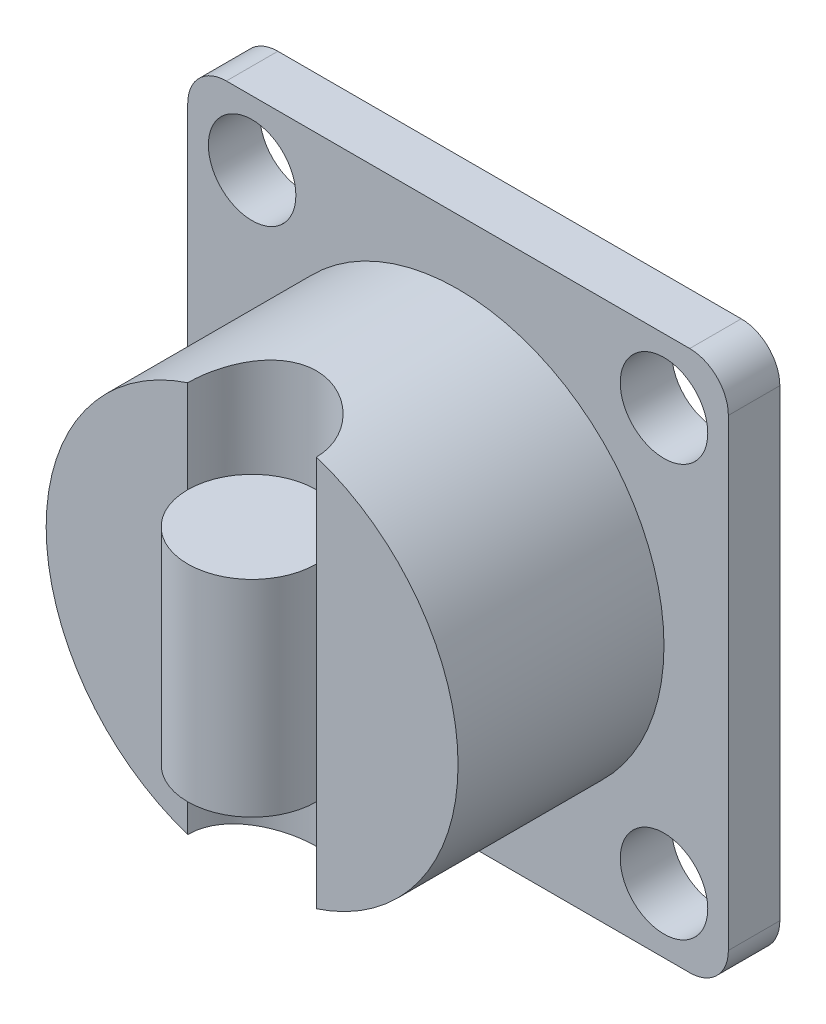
from build123d import *

# Parameters (mm, degrees)
ESQUISSE1_W                     = 21
ESQUISSE1_H                     = 21
EXTRUSION1_DEPTH                = 2
ESQUISSE2_R                     = 8
EXTRUSION2_DEPTH                = 8
ESQUISSE3_R                     = 2.5
ENL_V_MAT_EXTRU_1_DEPTH         = 32.336879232
ESQUISSE4_R                     = 2.5
EXTRUSION3_DEPTH                = 4
D_GAGEMENT_M31_D                = 3.4
R_P_TITION_LIN_AIRE1_COUNT      = 2
R_P_TITION_LIN_AIRE1_PITCH      = 16
R_P_TITION_LIN_AIRE1_COUNT_DIR2 = 2
R_P_TITION_LIN_AIRE1_PITCH_DIR2 = 16
CONG_1_R                        = 1.5


with BuildPart() as part:
    # Esquisse1 → Extrusion1 (new body)
    with BuildSketch(Plane.XY):
        with Locations((-10.5, 10.5)):
            Rectangle(ESQUISSE1_W, ESQUISSE1_H)
    extrude(amount=EXTRUSION1_DEPTH)

    # Esquisse2 → Extrusion2 (add)
    with BuildSketch(Plane.XY.offset(2)):
        with Locations((-10.5, 10.5)):
            Circle(ESQUISSE2_R)
    extrude(amount=EXTRUSION2_DEPTH)

    # Esquisse3 → Enl_v. mat.-Extru.1 (cut, through all)
    with BuildSketch(Plane(origin=(0, 21, 0), x_dir=(-1, 0, 0), z_dir=(0, 1, 0))):
        with Locations((10.5, 10)):
            Circle(ESQUISSE3_R)
    extrude(amount=-ENL_V_MAT_EXTRU_1_DEPTH, mode=Mode.SUBTRACT)

    # Esquisse4 → Extrusion3 (add, symmetric)
    with BuildSketch(Plane(origin=(0, 10.5, 0), x_dir=(-1, 0, 0), z_dir=(0, 1, 0))):
        with Locations((10.5, 10)):
            Circle(ESQUISSE4_R)
    extrude(amount=EXTRUSION3_DEPTH, both=True)

    # D_gagement M31 (through all)
    with Locations(Plane.XY.offset(2)):
        with Locations((-2.5, 18.5)):
            d_gagement_m31 = Hole(D_GAGEMENT_M31_D / 2)

    # R_p_tition lin_aire1: D_gagement M31 2 × 2
    with Locations(*[(-j * R_P_TITION_LIN_AIRE1_PITCH_DIR2, -i * R_P_TITION_LIN_AIRE1_PITCH, 0) for i in range(R_P_TITION_LIN_AIRE1_COUNT) for j in range(R_P_TITION_LIN_AIRE1_COUNT_DIR2) if (i, j) != (0, 0)]):
        add(d_gagement_m31, mode=Mode.SUBTRACT)

    # Cong_1
    cong_1_edges = [part.edges().sort_by_distance(p)[0] for p in [
        (-21, 21, 1),
        (0, 21, 1),
        (0, 0, 1),
        (-21, 0, 1),
    ]]
    fillet(cong_1_edges, radius=CONG_1_R)


solid = part.part
